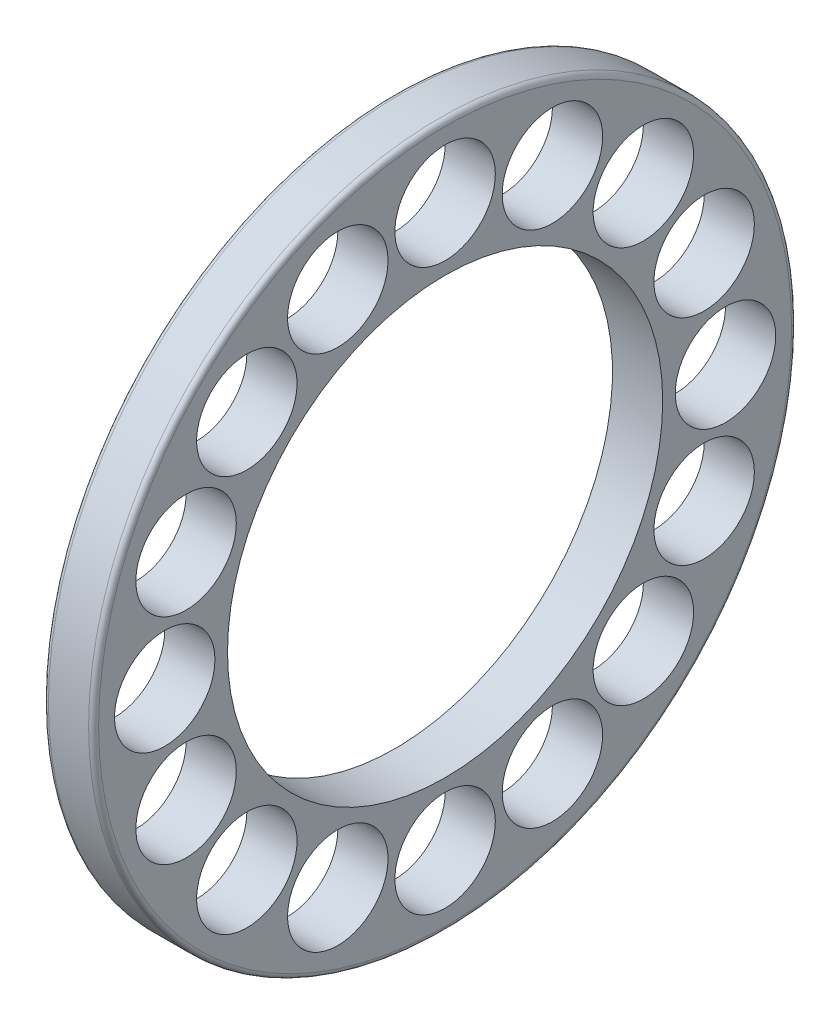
ISO-10303-21;
HEADER;
FILE_DESCRIPTION(('STEP AP214'),'2;1');
FILE_NAME('part.step','',(''),(''),'','','');
FILE_SCHEMA(('AUTOMOTIVE_DESIGN { 1 0 10303 214 1 1 1 1 }'));
ENDSEC;
DATA;
#1=APPLICATION_CONTEXT('core data for automotive mechanical design processes');
#2=APPLICATION_PROTOCOL_DEFINITION('international standard','automotive_design',2000,#1);
#3=PRODUCT_CONTEXT('',#1,'mechanical');
#4=PRODUCT('Part','Part','',(#3));
#5=PRODUCT_RELATED_PRODUCT_CATEGORY('part','',(#4));
#6=PRODUCT_DEFINITION_FORMATION('','',#4);
#7=PRODUCT_DEFINITION_CONTEXT('part definition',#1,'design');
#8=PRODUCT_DEFINITION('design','',#6,#7);
#9=PRODUCT_DEFINITION_SHAPE('','',#8);
#10=(LENGTH_UNIT() NAMED_UNIT(*) SI_UNIT(.MILLI.,.METRE.));
#11=(NAMED_UNIT(*) PLANE_ANGLE_UNIT() SI_UNIT($,.RADIAN.));
#12=(NAMED_UNIT(*) SI_UNIT($,.STERADIAN.) SOLID_ANGLE_UNIT());
#13=UNCERTAINTY_MEASURE_WITH_UNIT(LENGTH_MEASURE(1.E-05),#10,'distance_accuracy_value','');
#14=(GEOMETRIC_REPRESENTATION_CONTEXT(3) GLOBAL_UNCERTAINTY_ASSIGNED_CONTEXT((#13)) GLOBAL_UNIT_ASSIGNED_CONTEXT((#10,
#11,#12)) REPRESENTATION_CONTEXT('',''));
#15=CARTESIAN_POINT('',(0.,0.,0.));
#16=DIRECTION('',(0.,0.,1.));
#17=DIRECTION('',(1.,0.,0.));
#18=AXIS2_PLACEMENT_3D('',#15,#16,#17);
#19=CARTESIAN_POINT('',(4.,-21.0845303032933,-20.7));
#20=DIRECTION('',(-1.,0.,0.));
#21=DIRECTION('',(0.,0.,1.));
#22=AXIS2_PLACEMENT_3D('',#19,#20,#21);
#23=PLANE('',#22);
#24=CARTESIAN_POINT('',(4.,0.,0.));
#25=DIRECTION('',(-1.,0.,0.));
#26=DIRECTION('',(0.,0.,-1.));
#27=AXIS2_PLACEMENT_3D('',#24,#25,#26);
#28=CIRCLE('',#27,20.7000000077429);
#29=CARTESIAN_POINT('',(4.,0.,-20.7000000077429));
#30=VERTEX_POINT('',#29);
#31=EDGE_CURVE('E134',#30,#30,#28,.F.);
#32=ORIENTED_EDGE('',*,*,#31,.F.);
#33=EDGE_LOOP('',(#32));
#34=FACE_BOUND('',#33,.T.);
#35=CARTESIAN_POINT('',(4.,0.,0.));
#36=DIRECTION('',(1.,0.,0.));
#37=DIRECTION('',(0.,0.,1.));
#38=AXIS2_PLACEMENT_3D('',#35,#36,#37);
#39=CIRCLE('',#38,13.);
#40=CARTESIAN_POINT('',(4.,0.,13.));
#41=VERTEX_POINT('',#40);
#42=EDGE_CURVE('E131',#41,#41,#39,.T.);
#43=ORIENTED_EDGE('',*,*,#42,.T.);
#44=EDGE_LOOP('',(#43));
#45=FACE_BOUND('',#44,.T.);
#46=CARTESIAN_POINT('',(4.,-15.474982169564,-6.4099474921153));
#47=DIRECTION('',(1.,0.,0.));
#48=DIRECTION('',(0.,0.,1.));
#49=AXIS2_PLACEMENT_3D('',#46,#47,#48);
#50=CIRCLE('',#49,3.);
#51=CARTESIAN_POINT('',(4.,-15.474982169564,-3.4099474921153));
#52=VERTEX_POINT('',#51);
#53=EDGE_CURVE('E128',#52,#52,#50,.T.);
#54=ORIENTED_EDGE('',*,*,#53,.T.);
#55=EDGE_LOOP('',(#54));
#56=FACE_BOUND('',#55,.T.);
#57=CARTESIAN_POINT('',(4.,-16.75,0.));
#58=DIRECTION('',(1.,0.,0.));
#59=DIRECTION('',(0.,0.,1.));
#60=AXIS2_PLACEMENT_3D('',#57,#58,#59);
#61=CIRCLE('',#60,3.);
#62=CARTESIAN_POINT('',(4.,-16.75,3.));
#63=VERTEX_POINT('',#62);
#64=EDGE_CURVE('E125',#63,#63,#61,.T.);
#65=ORIENTED_EDGE('',*,*,#64,.T.);
#66=EDGE_LOOP('',(#65));
#67=FACE_BOUND('',#66,.T.);
#68=CARTESIAN_POINT('',(4.,-11.844038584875,11.844038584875));
#69=DIRECTION('',(1.,0.,0.));
#70=DIRECTION('',(0.,0.,1.));
#71=AXIS2_PLACEMENT_3D('',#68,#69,#70);
#72=CIRCLE('',#71,3.);
#73=CARTESIAN_POINT('',(4.,-11.844038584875,14.844038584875));
#74=VERTEX_POINT('',#73);
#75=EDGE_CURVE('E122',#74,#74,#72,.T.);
#76=ORIENTED_EDGE('',*,*,#75,.T.);
#77=EDGE_LOOP('',(#76));
#78=FACE_BOUND('',#77,.T.);
#79=CARTESIAN_POINT('',(4.,-15.474982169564,6.4099474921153));
#80=DIRECTION('',(1.,0.,0.));
#81=DIRECTION('',(0.,0.,1.));
#82=AXIS2_PLACEMENT_3D('',#79,#80,#81);
#83=CIRCLE('',#82,3.);
#84=CARTESIAN_POINT('',(4.,-15.474982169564,9.4099474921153));
#85=VERTEX_POINT('',#84);
#86=EDGE_CURVE('E119',#85,#85,#83,.T.);
#87=ORIENTED_EDGE('',*,*,#86,.T.);
#88=EDGE_LOOP('',(#87));
#89=FACE_BOUND('',#88,.T.);
#90=CARTESIAN_POINT('',(4.,-6.4099474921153,15.474982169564));
#91=DIRECTION('',(1.,0.,0.));
#92=DIRECTION('',(0.,0.,1.));
#93=AXIS2_PLACEMENT_3D('',#90,#91,#92);
#94=CIRCLE('',#93,3.);
#95=CARTESIAN_POINT('',(4.,-6.4099474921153,18.474982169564));
#96=VERTEX_POINT('',#95);
#97=EDGE_CURVE('E116',#96,#96,#94,.T.);
#98=ORIENTED_EDGE('',*,*,#97,.T.);
#99=EDGE_LOOP('',(#98));
#100=FACE_BOUND('',#99,.T.);
#101=CARTESIAN_POINT('',(4.,0.,16.75));
#102=DIRECTION('',(1.,0.,0.));
#103=DIRECTION('',(0.,0.,1.));
#104=AXIS2_PLACEMENT_3D('',#101,#102,#103);
#105=CIRCLE('',#104,3.);
#106=CARTESIAN_POINT('',(4.,0.,19.75));
#107=VERTEX_POINT('',#106);
#108=EDGE_CURVE('E113',#107,#107,#105,.T.);
#109=ORIENTED_EDGE('',*,*,#108,.T.);
#110=EDGE_LOOP('',(#109));
#111=FACE_BOUND('',#110,.T.);
#112=CARTESIAN_POINT('',(4.,11.844038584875,11.844038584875));
#113=DIRECTION('',(1.,0.,0.));
#114=DIRECTION('',(0.,0.,1.));
#115=AXIS2_PLACEMENT_3D('',#112,#113,#114);
#116=CIRCLE('',#115,3.);
#117=CARTESIAN_POINT('',(4.,11.844038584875,14.844038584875));
#118=VERTEX_POINT('',#117);
#119=EDGE_CURVE('E110',#118,#118,#116,.T.);
#120=ORIENTED_EDGE('',*,*,#119,.T.);
#121=EDGE_LOOP('',(#120));
#122=FACE_BOUND('',#121,.T.);
#123=CARTESIAN_POINT('',(4.,6.4099474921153,15.474982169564));
#124=DIRECTION('',(1.,0.,0.));
#125=DIRECTION('',(0.,0.,1.));
#126=AXIS2_PLACEMENT_3D('',#123,#124,#125);
#127=CIRCLE('',#126,3.);
#128=CARTESIAN_POINT('',(4.,6.40994749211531,18.474982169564));
#129=VERTEX_POINT('',#128);
#130=EDGE_CURVE('E107',#129,#129,#127,.T.);
#131=ORIENTED_EDGE('',*,*,#130,.T.);
#132=EDGE_LOOP('',(#131));
#133=FACE_BOUND('',#132,.T.);
#134=CARTESIAN_POINT('',(4.,11.844038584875,-11.844038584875));
#135=DIRECTION('',(1.,0.,0.));
#136=DIRECTION('',(0.,0.,1.));
#137=AXIS2_PLACEMENT_3D('',#134,#135,#136);
#138=CIRCLE('',#137,3.);
#139=CARTESIAN_POINT('',(4.,11.844038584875,-8.844038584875));
#140=VERTEX_POINT('',#139);
#141=EDGE_CURVE('E104',#140,#140,#138,.T.);
#142=ORIENTED_EDGE('',*,*,#141,.T.);
#143=EDGE_LOOP('',(#142));
#144=FACE_BOUND('',#143,.T.);
#145=CARTESIAN_POINT('',(4.,15.474982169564,-6.4099474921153));
#146=DIRECTION('',(1.,0.,0.));
#147=DIRECTION('',(0.,0.,1.));
#148=AXIS2_PLACEMENT_3D('',#145,#146,#147);
#149=CIRCLE('',#148,3.);
#150=CARTESIAN_POINT('',(4.,15.474982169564,-3.4099474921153));
#151=VERTEX_POINT('',#150);
#152=EDGE_CURVE('E101',#151,#151,#149,.T.);
#153=ORIENTED_EDGE('',*,*,#152,.T.);
#154=EDGE_LOOP('',(#153));
#155=FACE_BOUND('',#154,.T.);
#156=CARTESIAN_POINT('',(4.,6.4099474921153,-15.474982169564));
#157=DIRECTION('',(1.,0.,0.));
#158=DIRECTION('',(0.,0.,1.));
#159=AXIS2_PLACEMENT_3D('',#156,#157,#158);
#160=CIRCLE('',#159,3.);
#161=CARTESIAN_POINT('',(4.,6.40994749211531,-12.474982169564));
#162=VERTEX_POINT('',#161);
#163=EDGE_CURVE('E98',#162,#162,#160,.T.);
#164=ORIENTED_EDGE('',*,*,#163,.T.);
#165=EDGE_LOOP('',(#164));
#166=FACE_BOUND('',#165,.T.);
#167=CARTESIAN_POINT('',(4.,0.,-16.75));
#168=DIRECTION('',(1.,0.,0.));
#169=DIRECTION('',(0.,0.,1.));
#170=AXIS2_PLACEMENT_3D('',#167,#168,#169);
#171=CIRCLE('',#170,3.);
#172=CARTESIAN_POINT('',(4.,0.,-13.75));
#173=VERTEX_POINT('',#172);
#174=EDGE_CURVE('E95',#173,#173,#171,.T.);
#175=ORIENTED_EDGE('',*,*,#174,.T.);
#176=EDGE_LOOP('',(#175));
#177=FACE_BOUND('',#176,.T.);
#178=CARTESIAN_POINT('',(4.,-11.844038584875,-11.844038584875));
#179=DIRECTION('',(1.,0.,0.));
#180=DIRECTION('',(0.,0.,1.));
#181=AXIS2_PLACEMENT_3D('',#178,#179,#180);
#182=CIRCLE('',#181,3.);
#183=CARTESIAN_POINT('',(4.,-11.844038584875,-8.844038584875));
#184=VERTEX_POINT('',#183);
#185=EDGE_CURVE('E92',#184,#184,#182,.T.);
#186=ORIENTED_EDGE('',*,*,#185,.T.);
#187=EDGE_LOOP('',(#186));
#188=FACE_BOUND('',#187,.T.);
#189=CARTESIAN_POINT('',(4.,-6.4099474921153,-15.474982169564));
#190=DIRECTION('',(1.,0.,0.));
#191=DIRECTION('',(0.,0.,1.));
#192=AXIS2_PLACEMENT_3D('',#189,#190,#191);
#193=CIRCLE('',#192,3.);
#194=CARTESIAN_POINT('',(4.,-6.4099474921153,-12.474982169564));
#195=VERTEX_POINT('',#194);
#196=EDGE_CURVE('E89',#195,#195,#193,.T.);
#197=ORIENTED_EDGE('',*,*,#196,.T.);
#198=EDGE_LOOP('',(#197));
#199=FACE_BOUND('',#198,.T.);
#200=CARTESIAN_POINT('',(4.,15.474982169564,6.4099474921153));
#201=DIRECTION('',(1.,0.,0.));
#202=DIRECTION('',(0.,0.,1.));
#203=AXIS2_PLACEMENT_3D('',#200,#201,#202);
#204=CIRCLE('',#203,3.);
#205=CARTESIAN_POINT('',(4.,15.474982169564,9.4099474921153));
#206=VERTEX_POINT('',#205);
#207=EDGE_CURVE('E86',#206,#206,#204,.T.);
#208=ORIENTED_EDGE('',*,*,#207,.T.);
#209=EDGE_LOOP('',(#208));
#210=FACE_BOUND('',#209,.T.);
#211=CARTESIAN_POINT('',(4.,16.75,0.));
#212=DIRECTION('',(1.,0.,0.));
#213=DIRECTION('',(0.,0.,1.));
#214=AXIS2_PLACEMENT_3D('',#211,#212,#213);
#215=CIRCLE('',#214,3.);
#216=CARTESIAN_POINT('',(4.,16.75,3.));
#217=VERTEX_POINT('',#216);
#218=EDGE_CURVE('E83',#217,#217,#215,.T.);
#219=ORIENTED_EDGE('',*,*,#218,.T.);
#220=EDGE_LOOP('',(#219));
#221=FACE_BOUND('',#220,.T.);
#222=ADVANCED_FACE('F15',(#34,#45,#56,#67,#78,#89,#100,#111,#122,#133,#144,#155,#166,#177,#188,
#199,#210,#221),#23,.T.);
#223=CARTESIAN_POINT('',(7.,-21.0845303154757,20.7));
#224=DIRECTION('',(1.,0.,0.));
#225=DIRECTION('',(0.,0.,-1.));
#226=AXIS2_PLACEMENT_3D('',#223,#224,#225);
#227=PLANE('',#226);
#228=CARTESIAN_POINT('',(7.,0.,0.));
#229=DIRECTION('',(1.,0.,0.));
#230=DIRECTION('',(0.,0.,1.));
#231=AXIS2_PLACEMENT_3D('',#228,#229,#230);
#232=CIRCLE('',#231,20.7);
#233=CARTESIAN_POINT('',(7.,0.,20.7));
#234=VERTEX_POINT('',#233);
#235=EDGE_CURVE('E80',#234,#234,#232,.T.);
#236=ORIENTED_EDGE('',*,*,#235,.T.);
#237=EDGE_LOOP('',(#236));
#238=FACE_BOUND('',#237,.T.);
#239=CARTESIAN_POINT('',(7.,0.,0.));
#240=DIRECTION('',(-1.,0.,0.));
#241=DIRECTION('',(0.,0.,-1.));
#242=AXIS2_PLACEMENT_3D('',#239,#240,#241);
#243=CIRCLE('',#242,13.);
#244=CARTESIAN_POINT('',(7.,0.,-13.));
#245=VERTEX_POINT('',#244);
#246=EDGE_CURVE('E77',#245,#245,#243,.F.);
#247=ORIENTED_EDGE('',*,*,#246,.F.);
#248=EDGE_LOOP('',(#247));
#249=FACE_BOUND('',#248,.T.);
#250=CARTESIAN_POINT('',(7.,-15.474982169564,-6.4099474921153));
#251=DIRECTION('',(-1.,0.,0.));
#252=DIRECTION('',(0.,0.,-1.));
#253=AXIS2_PLACEMENT_3D('',#250,#251,#252);
#254=CIRCLE('',#253,3.);
#255=CARTESIAN_POINT('',(7.,-15.474982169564,-9.4099474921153));
#256=VERTEX_POINT('',#255);
#257=EDGE_CURVE('E74',#256,#256,#254,.T.);
#258=ORIENTED_EDGE('',*,*,#257,.T.);
#259=EDGE_LOOP('',(#258));
#260=FACE_BOUND('',#259,.T.);
#261=CARTESIAN_POINT('',(7.,-16.75,0.));
#262=DIRECTION('',(-1.,0.,0.));
#263=DIRECTION('',(0.,-1.42053912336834E-07,-0.99999999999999));
#264=AXIS2_PLACEMENT_3D('',#261,#262,#263);
#265=CIRCLE('',#264,3.);
#266=CARTESIAN_POINT('',(7.,-16.7500004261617,-2.99999999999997));
#267=VERTEX_POINT('',#266);
#268=EDGE_CURVE('E71',#267,#267,#265,.T.);
#269=ORIENTED_EDGE('',*,*,#268,.T.);
#270=EDGE_LOOP('',(#269));
#271=FACE_BOUND('',#270,.T.);
#272=CARTESIAN_POINT('',(7.,-11.844038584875,11.844038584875));
#273=DIRECTION('',(-1.,0.,0.));
#274=DIRECTION('',(0.,0.,-1.));
#275=AXIS2_PLACEMENT_3D('',#272,#273,#274);
#276=CIRCLE('',#275,3.);
#277=CARTESIAN_POINT('',(7.,-11.844038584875,8.844038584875));
#278=VERTEX_POINT('',#277);
#279=EDGE_CURVE('E68',#278,#278,#276,.T.);
#280=ORIENTED_EDGE('',*,*,#279,.T.);
#281=EDGE_LOOP('',(#280));
#282=FACE_BOUND('',#281,.T.);
#283=CARTESIAN_POINT('',(7.,-15.474982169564,6.4099474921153));
#284=DIRECTION('',(-1.,0.,0.));
#285=DIRECTION('',(0.,-1.42053896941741E-07,-0.99999999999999));
#286=AXIS2_PLACEMENT_3D('',#283,#284,#285);
#287=CIRCLE('',#286,3.);
#288=CARTESIAN_POINT('',(7.,-15.4749825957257,3.40994749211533));
#289=VERTEX_POINT('',#288);
#290=EDGE_CURVE('E65',#289,#289,#287,.T.);
#291=ORIENTED_EDGE('',*,*,#290,.T.);
#292=EDGE_LOOP('',(#291));
#293=FACE_BOUND('',#292,.T.);
#294=CARTESIAN_POINT('',(7.,-6.4099474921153,15.474982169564));
#295=DIRECTION('',(-1.,0.,0.));
#296=DIRECTION('',(0.,0.,-1.));
#297=AXIS2_PLACEMENT_3D('',#294,#295,#296);
#298=CIRCLE('',#297,3.);
#299=CARTESIAN_POINT('',(7.,-6.4099474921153,12.474982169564));
#300=VERTEX_POINT('',#299);
#301=EDGE_CURVE('E62',#300,#300,#298,.T.);
#302=ORIENTED_EDGE('',*,*,#301,.T.);
#303=EDGE_LOOP('',(#302));
#304=FACE_BOUND('',#303,.T.);
#305=CARTESIAN_POINT('',(7.,0.,16.75));
#306=DIRECTION('',(-1.,0.,0.));
#307=DIRECTION('',(0.,0.,-1.));
#308=AXIS2_PLACEMENT_3D('',#305,#306,#307);
#309=CIRCLE('',#308,3.);
#310=CARTESIAN_POINT('',(7.,0.,13.75));
#311=VERTEX_POINT('',#310);
#312=EDGE_CURVE('E59',#311,#311,#309,.T.);
#313=ORIENTED_EDGE('',*,*,#312,.T.);
#314=EDGE_LOOP('',(#313));
#315=FACE_BOUND('',#314,.T.);
#316=CARTESIAN_POINT('',(7.,11.844038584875,11.844038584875));
#317=DIRECTION('',(-1.,0.,0.));
#318=DIRECTION('',(0.,0.,-1.));
#319=AXIS2_PLACEMENT_3D('',#316,#317,#318);
#320=CIRCLE('',#319,3.);
#321=CARTESIAN_POINT('',(7.,11.844038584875,8.844038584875));
#322=VERTEX_POINT('',#321);
#323=EDGE_CURVE('E56',#322,#322,#320,.T.);
#324=ORIENTED_EDGE('',*,*,#323,.T.);
#325=EDGE_LOOP('',(#324));
#326=FACE_BOUND('',#325,.T.);
#327=CARTESIAN_POINT('',(7.,6.4099474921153,15.474982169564));
#328=DIRECTION('',(-1.,0.,0.));
#329=DIRECTION('',(0.,0.,-1.));
#330=AXIS2_PLACEMENT_3D('',#327,#328,#329);
#331=CIRCLE('',#330,3.);
#332=CARTESIAN_POINT('',(7.,6.40994749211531,12.474982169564));
#333=VERTEX_POINT('',#332);
#334=EDGE_CURVE('E53',#333,#333,#331,.T.);
#335=ORIENTED_EDGE('',*,*,#334,.T.);
#336=EDGE_LOOP('',(#335));
#337=FACE_BOUND('',#336,.T.);
#338=CARTESIAN_POINT('',(7.,11.844038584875,-11.844038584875));
#339=DIRECTION('',(-1.,0.,0.));
#340=DIRECTION('',(0.,0.,-1.));
#341=AXIS2_PLACEMENT_3D('',#338,#339,#340);
#342=CIRCLE('',#341,3.);
#343=CARTESIAN_POINT('',(7.,11.844038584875,-14.844038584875));
#344=VERTEX_POINT('',#343);
#345=EDGE_CURVE('E50',#344,#344,#342,.T.);
#346=ORIENTED_EDGE('',*,*,#345,.T.);
#347=EDGE_LOOP('',(#346));
#348=FACE_BOUND('',#347,.T.);
#349=CARTESIAN_POINT('',(7.,15.474982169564,-6.4099474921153));
#350=DIRECTION('',(-1.,0.,0.));
#351=DIRECTION('',(0.,0.,-1.));
#352=AXIS2_PLACEMENT_3D('',#349,#350,#351);
#353=CIRCLE('',#352,3.);
#354=CARTESIAN_POINT('',(7.,15.474982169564,-9.4099474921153));
#355=VERTEX_POINT('',#354);
#356=EDGE_CURVE('E47',#355,#355,#353,.T.);
#357=ORIENTED_EDGE('',*,*,#356,.T.);
#358=EDGE_LOOP('',(#357));
#359=FACE_BOUND('',#358,.T.);
#360=CARTESIAN_POINT('',(7.,6.4099474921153,-15.474982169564));
#361=DIRECTION('',(-1.,0.,0.));
#362=DIRECTION('',(0.,-1.42053860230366E-07,-0.99999999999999));
#363=AXIS2_PLACEMENT_3D('',#360,#361,#362);
#364=CIRCLE('',#363,3.);
#365=CARTESIAN_POINT('',(7.,6.40994706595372,-18.474982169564));
#366=VERTEX_POINT('',#365);
#367=EDGE_CURVE('E44',#366,#366,#364,.T.);
#368=ORIENTED_EDGE('',*,*,#367,.T.);
#369=EDGE_LOOP('',(#368));
#370=FACE_BOUND('',#369,.T.);
#371=CARTESIAN_POINT('',(7.,0.,-16.75));
#372=DIRECTION('',(-1.,0.,0.));
#373=DIRECTION('',(0.,-1.4205386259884E-07,-0.99999999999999));
#374=AXIS2_PLACEMENT_3D('',#371,#372,#373);
#375=CIRCLE('',#374,3.);
#376=CARTESIAN_POINT('',(7.,-4.26161587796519E-07,-19.75));
#377=VERTEX_POINT('',#376);
#378=EDGE_CURVE('E41',#377,#377,#375,.T.);
#379=ORIENTED_EDGE('',*,*,#378,.T.);
#380=EDGE_LOOP('',(#379));
#381=FACE_BOUND('',#380,.T.);
#382=CARTESIAN_POINT('',(7.,-11.844038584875,-11.844038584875));
#383=DIRECTION('',(-1.,0.,0.));
#384=DIRECTION('',(0.,0.,-1.));
#385=AXIS2_PLACEMENT_3D('',#382,#383,#384);
#386=CIRCLE('',#385,3.);
#387=CARTESIAN_POINT('',(7.,-11.844038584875,-14.844038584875));
#388=VERTEX_POINT('',#387);
#389=EDGE_CURVE('E38',#388,#388,#386,.T.);
#390=ORIENTED_EDGE('',*,*,#389,.T.);
#391=EDGE_LOOP('',(#390));
#392=FACE_BOUND('',#391,.T.);
#393=CARTESIAN_POINT('',(7.,-6.4099474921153,-15.474982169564));
#394=DIRECTION('',(-1.,0.,0.));
#395=DIRECTION('',(0.,-1.4205386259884E-07,-0.99999999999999));
#396=AXIS2_PLACEMENT_3D('',#393,#394,#395);
#397=CIRCLE('',#396,3.);
#398=CARTESIAN_POINT('',(7.,-6.40994791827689,-18.474982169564));
#399=VERTEX_POINT('',#398);
#400=EDGE_CURVE('E35',#399,#399,#397,.T.);
#401=ORIENTED_EDGE('',*,*,#400,.T.);
#402=EDGE_LOOP('',(#401));
#403=FACE_BOUND('',#402,.T.);
#404=CARTESIAN_POINT('',(7.,15.474982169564,6.4099474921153));
#405=DIRECTION('',(-1.,0.,0.));
#406=DIRECTION('',(0.,-1.42053860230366E-07,-0.99999999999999));
#407=AXIS2_PLACEMENT_3D('',#404,#405,#406);
#408=CIRCLE('',#407,3.);
#409=CARTESIAN_POINT('',(7.,15.4749817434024,3.40994749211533));
#410=VERTEX_POINT('',#409);
#411=EDGE_CURVE('E30',#410,#410,#408,.T.);
#412=ORIENTED_EDGE('',*,*,#411,.T.);
#413=EDGE_LOOP('',(#412));
#414=FACE_BOUND('',#413,.T.);
#415=CARTESIAN_POINT('',(7.,16.75,0.));
#416=DIRECTION('',(-1.,0.,0.));
#417=DIRECTION('',(0.,-1.42053893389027E-07,-0.99999999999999));
#418=AXIS2_PLACEMENT_3D('',#415,#416,#417);
#419=CIRCLE('',#418,3.);
#420=CARTESIAN_POINT('',(7.,16.7499995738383,-2.99999999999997));
#421=VERTEX_POINT('',#420);
#422=EDGE_CURVE('E26',#421,#421,#419,.T.);
#423=ORIENTED_EDGE('',*,*,#422,.T.);
#424=EDGE_LOOP('',(#423));
#425=FACE_BOUND('',#424,.T.);
#426=ADVANCED_FACE('F143',(#238,#249,#260,#271,#282,#293,#304,#315,#326,#337,#348,#359,#370,
#381,#392,#403,#414,#425),#227,.T.);
#427=CARTESIAN_POINT('',(4.29999999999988,0.,0.));
#428=DIRECTION('',(1.,0.,0.));
#429=DIRECTION('',(0.,1.1683943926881E-09,1.));
#430=AXIS2_PLACEMENT_3D('',#427,#428,#429);
#431=TOROIDAL_SURFACE('',#430,20.7,0.29999999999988);
#432=ORIENTED_EDGE('',*,*,#31,.T.);
#433=EDGE_LOOP('',(#432));
#434=FACE_BOUND('',#433,.T.);
#435=CARTESIAN_POINT('',(4.29999999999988,0.,0.));
#436=DIRECTION('',(-1.,0.,0.));
#437=DIRECTION('',(0.,0.,-1.));
#438=AXIS2_PLACEMENT_3D('',#435,#436,#437);
#439=CIRCLE('',#438,20.9999999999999);
#440=CARTESIAN_POINT('',(4.29999999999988,0.,-20.9999999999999));
#441=VERTEX_POINT('',#440);
#442=EDGE_CURVE('E22',#441,#441,#439,.F.);
#443=ORIENTED_EDGE('',*,*,#442,.F.);
#444=EDGE_LOOP('',(#443));
#445=FACE_BOUND('',#444,.T.);
#446=ADVANCED_FACE('F138',(#434,#445),#431,.T.);
#447=CARTESIAN_POINT('',(7.,0.,0.));
#448=DIRECTION('',(1.,0.,0.));
#449=DIRECTION('',(0.,0.,1.));
#450=AXIS2_PLACEMENT_3D('',#447,#448,#449);
#451=CYLINDRICAL_SURFACE('',#450,13.);
#452=ORIENTED_EDGE('',*,*,#246,.T.);
#453=EDGE_LOOP('',(#452));
#454=FACE_BOUND('',#453,.T.);
#455=ORIENTED_EDGE('',*,*,#42,.F.);
#456=EDGE_LOOP('',(#455));
#457=FACE_BOUND('',#456,.T.);
#458=ADVANCED_FACE('F194',(#454,#457),#451,.F.);
#459=CARTESIAN_POINT('',(6.70000000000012,0.,0.));
#460=DIRECTION('',(1.,0.,0.));
#461=DIRECTION('',(0.,0.,1.));
#462=AXIS2_PLACEMENT_3D('',#459,#460,#461);
#463=TOROIDAL_SURFACE('',#462,20.7,0.29999999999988);
#464=CARTESIAN_POINT('',(6.70000000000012,0.,0.));
#465=DIRECTION('',(1.,0.,0.));
#466=DIRECTION('',(0.,0.,1.));
#467=AXIS2_PLACEMENT_3D('',#464,#465,#466);
#468=CIRCLE('',#467,20.9999999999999);
#469=CARTESIAN_POINT('',(6.70000000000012,0.,20.9999999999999));
#470=VERTEX_POINT('',#469);
#471=EDGE_CURVE('E10',#470,#470,#468,.T.);
#472=ORIENTED_EDGE('',*,*,#471,.T.);
#473=EDGE_LOOP('',(#472));
#474=FACE_BOUND('',#473,.T.);
#475=ORIENTED_EDGE('',*,*,#235,.F.);
#476=EDGE_LOOP('',(#475));
#477=FACE_BOUND('',#476,.T.);
#478=ADVANCED_FACE('F200',(#474,#477),#463,.T.);
#479=CARTESIAN_POINT('',(7.,0.,0.));
#480=DIRECTION('',(1.,0.,0.));
#481=DIRECTION('',(0.,1.92316507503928E-10,1.));
#482=AXIS2_PLACEMENT_3D('',#479,#480,#481);
#483=CYLINDRICAL_SURFACE('',#482,21.);
#484=ORIENTED_EDGE('',*,*,#442,.T.);
#485=EDGE_LOOP('',(#484));
#486=FACE_BOUND('',#485,.T.);
#487=ORIENTED_EDGE('',*,*,#471,.F.);
#488=EDGE_LOOP('',(#487));
#489=FACE_BOUND('',#488,.T.);
#490=ADVANCED_FACE('F183',(#486,#489),#483,.T.);
#491=CARTESIAN_POINT('',(11.,16.75,0.));
#492=DIRECTION('',(-1.,0.,0.));
#493=DIRECTION('',(0.,0.,-1.));
#494=AXIS2_PLACEMENT_3D('',#491,#492,#493);
#495=CYLINDRICAL_SURFACE('',#494,3.);
#496=ORIENTED_EDGE('',*,*,#218,.F.);
#497=EDGE_LOOP('',(#496));
#498=FACE_BOUND('',#497,.T.);
#499=ORIENTED_EDGE('',*,*,#422,.F.);
#500=EDGE_LOOP('',(#499));
#501=FACE_BOUND('',#500,.T.);
#502=ADVANCED_FACE('F179',(#498,#501),#495,.F.);
#503=CARTESIAN_POINT('',(11.,15.474982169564,6.4099474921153));
#504=DIRECTION('',(-1.,0.,0.));
#505=DIRECTION('',(0.,1.42053912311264E-07,-0.99999999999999));
#506=AXIS2_PLACEMENT_3D('',#503,#504,#505);
#507=CYLINDRICAL_SURFACE('',#506,3.);
#508=ORIENTED_EDGE('',*,*,#207,.F.);
#509=EDGE_LOOP('',(#508));
#510=FACE_BOUND('',#509,.T.);
#511=ORIENTED_EDGE('',*,*,#411,.F.);
#512=EDGE_LOOP('',(#511));
#513=FACE_BOUND('',#512,.T.);
#514=ADVANCED_FACE('F182',(#510,#513),#507,.F.);
#515=CARTESIAN_POINT('',(11.,-6.4099474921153,-15.474982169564));
#516=DIRECTION('',(-1.,0.,0.));
#517=DIRECTION('',(0.,1.42053863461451E-07,-0.99999999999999));
#518=AXIS2_PLACEMENT_3D('',#515,#516,#517);
#519=CYLINDRICAL_SURFACE('',#518,3.);
#520=ORIENTED_EDGE('',*,*,#196,.F.);
#521=EDGE_LOOP('',(#520));
#522=FACE_BOUND('',#521,.T.);
#523=ORIENTED_EDGE('',*,*,#400,.F.);
#524=EDGE_LOOP('',(#523));
#525=FACE_BOUND('',#524,.T.);
#526=ADVANCED_FACE('F208',(#522,#525),#519,.F.);
#527=CARTESIAN_POINT('',(11.,-11.844038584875,-11.844038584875));
#528=DIRECTION('',(-1.,0.,0.));
#529=DIRECTION('',(0.,1.42053928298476E-07,-0.99999999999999));
#530=AXIS2_PLACEMENT_3D('',#527,#528,#529);
#531=CYLINDRICAL_SURFACE('',#530,3.);
#532=ORIENTED_EDGE('',*,*,#185,.F.);
#533=EDGE_LOOP('',(#532));
#534=FACE_BOUND('',#533,.T.);
#535=ORIENTED_EDGE('',*,*,#389,.F.);
#536=EDGE_LOOP('',(#535));
#537=FACE_BOUND('',#536,.T.);
#538=ADVANCED_FACE('F212',(#534,#537),#531,.F.);
#539=CARTESIAN_POINT('',(11.,0.,-16.75));
#540=DIRECTION('',(-1.,0.,0.));
#541=DIRECTION('',(0.,1.4205386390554E-07,-0.99999999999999));
#542=AXIS2_PLACEMENT_3D('',#539,#540,#541);
#543=CYLINDRICAL_SURFACE('',#542,3.);
#544=ORIENTED_EDGE('',*,*,#174,.F.);
#545=EDGE_LOOP('',(#544));
#546=FACE_BOUND('',#545,.T.);
#547=ORIENTED_EDGE('',*,*,#378,.F.);
#548=EDGE_LOOP('',(#547));
#549=FACE_BOUND('',#548,.T.);
#550=ADVANCED_FACE('F216',(#546,#549),#543,.F.);
#551=CARTESIAN_POINT('',(11.,6.4099474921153,-15.474982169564));
#552=DIRECTION('',(-1.,0.,0.));
#553=DIRECTION('',(0.,1.42053864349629E-07,-0.99999999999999));
#554=AXIS2_PLACEMENT_3D('',#551,#552,#553);
#555=CYLINDRICAL_SURFACE('',#554,3.);
#556=ORIENTED_EDGE('',*,*,#163,.F.);
#557=EDGE_LOOP('',(#556));
#558=FACE_BOUND('',#557,.T.);
#559=ORIENTED_EDGE('',*,*,#367,.F.);
#560=EDGE_LOOP('',(#559));
#561=FACE_BOUND('',#560,.T.);
#562=ADVANCED_FACE('F220',(#558,#561),#555,.F.);
#563=CARTESIAN_POINT('',(11.,15.474982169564,-6.4099474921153));
#564=DIRECTION('',(-1.,0.,0.));
#565=DIRECTION('',(0.,0.,-1.));
#566=AXIS2_PLACEMENT_3D('',#563,#564,#565);
#567=CYLINDRICAL_SURFACE('',#566,3.);
#568=ORIENTED_EDGE('',*,*,#152,.F.);
#569=EDGE_LOOP('',(#568));
#570=FACE_BOUND('',#569,.T.);
#571=ORIENTED_EDGE('',*,*,#356,.F.);
#572=EDGE_LOOP('',(#571));
#573=FACE_BOUND('',#572,.T.);
#574=ADVANCED_FACE('F224',(#570,#573),#567,.F.);
#575=CARTESIAN_POINT('',(11.,11.844038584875,-11.844038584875));
#576=DIRECTION('',(-1.,0.,0.));
#577=DIRECTION('',(0.,1.4205386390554E-07,-0.99999999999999));
#578=AXIS2_PLACEMENT_3D('',#575,#576,#577);
#579=CYLINDRICAL_SURFACE('',#578,3.);
#580=ORIENTED_EDGE('',*,*,#141,.F.);
#581=EDGE_LOOP('',(#580));
#582=FACE_BOUND('',#581,.T.);
#583=ORIENTED_EDGE('',*,*,#345,.F.);
#584=EDGE_LOOP('',(#583));
#585=FACE_BOUND('',#584,.T.);
#586=ADVANCED_FACE('F228',(#582,#585),#579,.F.);
#587=CARTESIAN_POINT('',(11.,6.4099474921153,15.474982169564));
#588=DIRECTION('',(-1.,0.,0.));
#589=DIRECTION('',(0.,0.,-1.));
#590=AXIS2_PLACEMENT_3D('',#587,#588,#589);
#591=CYLINDRICAL_SURFACE('',#590,3.);
#592=ORIENTED_EDGE('',*,*,#130,.F.);
#593=EDGE_LOOP('',(#592));
#594=FACE_BOUND('',#593,.T.);
#595=ORIENTED_EDGE('',*,*,#334,.F.);
#596=EDGE_LOOP('',(#595));
#597=FACE_BOUND('',#596,.T.);
#598=ADVANCED_FACE('F232',(#594,#597),#591,.F.);
#599=CARTESIAN_POINT('',(11.,11.844038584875,11.844038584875));
#600=DIRECTION('',(-1.,0.,0.));
#601=DIRECTION('',(0.,1.4205386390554E-07,-0.99999999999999));
#602=AXIS2_PLACEMENT_3D('',#599,#600,#601);
#603=CYLINDRICAL_SURFACE('',#602,3.);
#604=ORIENTED_EDGE('',*,*,#119,.F.);
#605=EDGE_LOOP('',(#604));
#606=FACE_BOUND('',#605,.T.);
#607=ORIENTED_EDGE('',*,*,#323,.F.);
#608=EDGE_LOOP('',(#607));
#609=FACE_BOUND('',#608,.T.);
#610=ADVANCED_FACE('F236',(#606,#609),#603,.F.);
#611=CARTESIAN_POINT('',(11.,0.,16.75));
#612=DIRECTION('',(-1.,0.,0.));
#613=DIRECTION('',(0.,0.,-1.));
#614=AXIS2_PLACEMENT_3D('',#611,#612,#613);
#615=CYLINDRICAL_SURFACE('',#614,3.);
#616=ORIENTED_EDGE('',*,*,#108,.F.);
#617=EDGE_LOOP('',(#616));
#618=FACE_BOUND('',#617,.T.);
#619=ORIENTED_EDGE('',*,*,#312,.F.);
#620=EDGE_LOOP('',(#619));
#621=FACE_BOUND('',#620,.T.);
#622=ADVANCED_FACE('F240',(#618,#621),#615,.F.);
#623=CARTESIAN_POINT('',(11.,-6.4099474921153,15.474982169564));
#624=DIRECTION('',(-1.,0.,0.));
#625=DIRECTION('',(0.,0.,-1.));
#626=AXIS2_PLACEMENT_3D('',#623,#624,#625);
#627=CYLINDRICAL_SURFACE('',#626,3.);
#628=ORIENTED_EDGE('',*,*,#97,.F.);
#629=EDGE_LOOP('',(#628));
#630=FACE_BOUND('',#629,.T.);
#631=ORIENTED_EDGE('',*,*,#301,.F.);
#632=EDGE_LOOP('',(#631));
#633=FACE_BOUND('',#632,.T.);
#634=ADVANCED_FACE('F244',(#630,#633),#627,.F.);
#635=CARTESIAN_POINT('',(11.,-15.474982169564,6.4099474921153));
#636=DIRECTION('',(-1.,0.,0.));
#637=DIRECTION('',(0.,0.,-1.));
#638=AXIS2_PLACEMENT_3D('',#635,#636,#637);
#639=CYLINDRICAL_SURFACE('',#638,3.);
#640=ORIENTED_EDGE('',*,*,#86,.F.);
#641=EDGE_LOOP('',(#640));
#642=FACE_BOUND('',#641,.T.);
#643=ORIENTED_EDGE('',*,*,#290,.F.);
#644=EDGE_LOOP('',(#643));
#645=FACE_BOUND('',#644,.T.);
#646=ADVANCED_FACE('F248',(#642,#645),#639,.F.);
#647=CARTESIAN_POINT('',(11.,-11.844038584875,11.844038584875));
#648=DIRECTION('',(-1.,0.,0.));
#649=DIRECTION('',(0.,1.42053928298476E-07,-0.99999999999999));
#650=AXIS2_PLACEMENT_3D('',#647,#648,#649);
#651=CYLINDRICAL_SURFACE('',#650,3.);
#652=ORIENTED_EDGE('',*,*,#75,.F.);
#653=EDGE_LOOP('',(#652));
#654=FACE_BOUND('',#653,.T.);
#655=ORIENTED_EDGE('',*,*,#279,.F.);
#656=EDGE_LOOP('',(#655));
#657=FACE_BOUND('',#656,.T.);
#658=ADVANCED_FACE('F252',(#654,#657),#651,.F.);
#659=CARTESIAN_POINT('',(11.,-16.75,0.));
#660=DIRECTION('',(-1.,0.,0.));
#661=DIRECTION('',(0.,0.,-1.));
#662=AXIS2_PLACEMENT_3D('',#659,#660,#661);
#663=CYLINDRICAL_SURFACE('',#662,3.);
#664=ORIENTED_EDGE('',*,*,#64,.F.);
#665=EDGE_LOOP('',(#664));
#666=FACE_BOUND('',#665,.T.);
#667=ORIENTED_EDGE('',*,*,#268,.F.);
#668=EDGE_LOOP('',(#667));
#669=FACE_BOUND('',#668,.T.);
#670=ADVANCED_FACE('F255',(#666,#669),#663,.F.);
#671=CARTESIAN_POINT('',(11.,-15.474982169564,-6.4099474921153));
#672=DIRECTION('',(-1.,0.,0.));
#673=DIRECTION('',(0.,0.,-1.));
#674=AXIS2_PLACEMENT_3D('',#671,#672,#673);
#675=CYLINDRICAL_SURFACE('',#674,3.);
#676=ORIENTED_EDGE('',*,*,#53,.F.);
#677=EDGE_LOOP('',(#676));
#678=FACE_BOUND('',#677,.T.);
#679=ORIENTED_EDGE('',*,*,#257,.F.);
#680=EDGE_LOOP('',(#679));
#681=FACE_BOUND('',#680,.T.);
#682=ADVANCED_FACE('F17',(#678,#681),#675,.F.);
#683=CLOSED_SHELL('',(#222,#426,#446,#458,#478,#490,#502,#514,#526,#538,#550,#562,#574,#586,
#598,#610,#622,#634,#646,#658,#670,#682));
#684=MANIFOLD_SOLID_BREP('B1',#683);
#685=ADVANCED_BREP_SHAPE_REPRESENTATION('',(#18,#684),#14);
#686=SHAPE_DEFINITION_REPRESENTATION(#9,#685);
ENDSEC;
END-ISO-10303-21;
